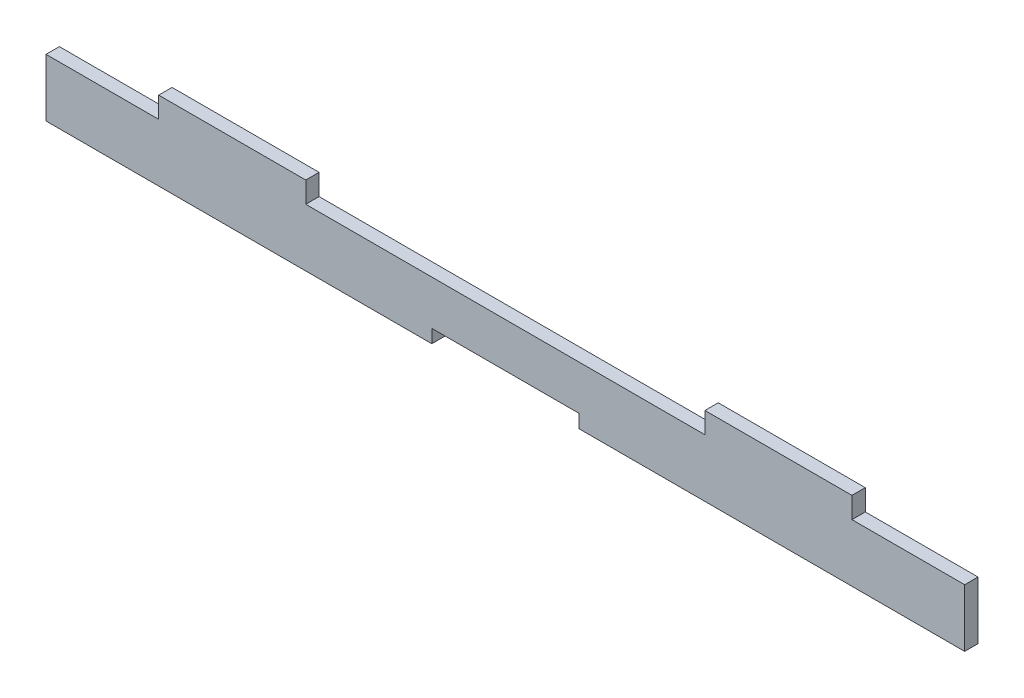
from build123d import *

# Parameters (mm, degrees)
BOSS_EXTRUDE1_DEPTH = 6.35


with BuildPart() as part:
    # Sketch1 → Boss-Extrude1 (new body)
    with BuildSketch(Plane.XY):
        Polygon((165, 13.75), (218.65, 13.75), (218.65, -13.75), (35, -13.75), (35, -7.4), (-35, -7.4), (-35, -13.75), (-218.65, -13.75), (-218.65, 13.75), (-165, 13.75), (-165, 23.75), (-95, 23.75), (-95, 13.75), (95, 13.75), (95, 23.75), (165, 23.75), align=None)
    extrude(amount=BOSS_EXTRUDE1_DEPTH)


solid = part.part
